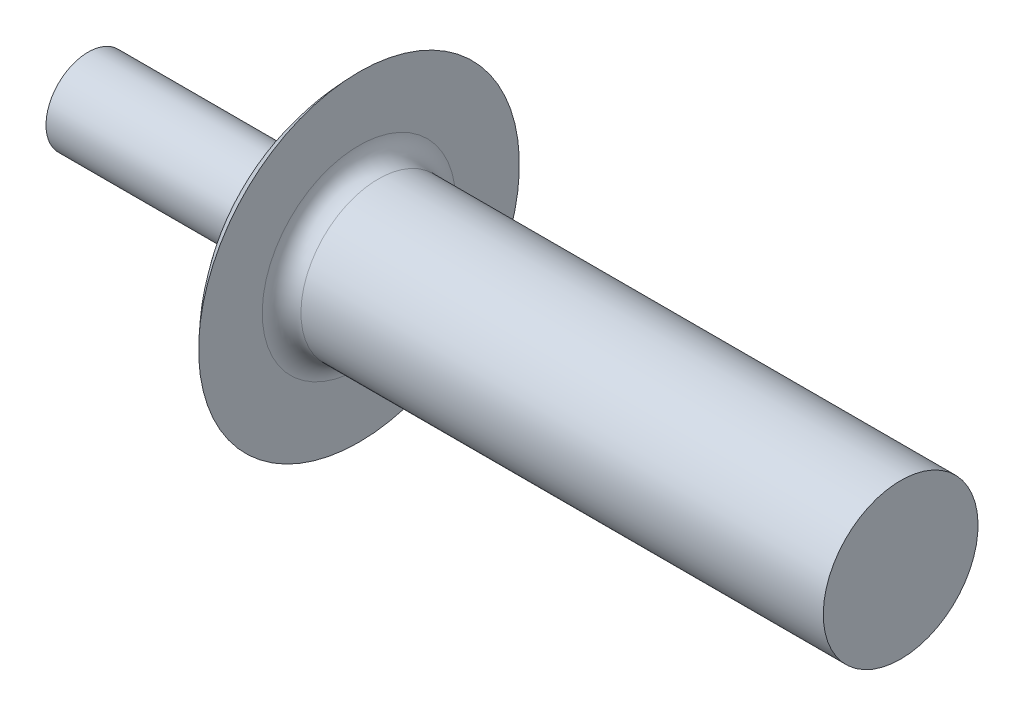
ISO-10303-21;
HEADER;
FILE_DESCRIPTION(('STEP AP214'),'2;1');
FILE_NAME('part.step','',(''),(''),'','','');
FILE_SCHEMA(('AUTOMOTIVE_DESIGN { 1 0 10303 214 1 1 1 1 }'));
ENDSEC;
DATA;
#1=APPLICATION_CONTEXT('core data for automotive mechanical design processes');
#2=APPLICATION_PROTOCOL_DEFINITION('international standard','automotive_design',2000,#1);
#3=PRODUCT_CONTEXT('',#1,'mechanical');
#4=PRODUCT('Part','Part','',(#3));
#5=PRODUCT_RELATED_PRODUCT_CATEGORY('part','',(#4));
#6=PRODUCT_DEFINITION_FORMATION('','',#4);
#7=PRODUCT_DEFINITION_CONTEXT('part definition',#1,'design');
#8=PRODUCT_DEFINITION('design','',#6,#7);
#9=PRODUCT_DEFINITION_SHAPE('','',#8);
#10=(LENGTH_UNIT() NAMED_UNIT(*) SI_UNIT(.MILLI.,.METRE.));
#11=(NAMED_UNIT(*) PLANE_ANGLE_UNIT() SI_UNIT($,.RADIAN.));
#12=(NAMED_UNIT(*) SI_UNIT($,.STERADIAN.) SOLID_ANGLE_UNIT());
#13=UNCERTAINTY_MEASURE_WITH_UNIT(LENGTH_MEASURE(1.E-05),#10,'distance_accuracy_value','');
#14=(GEOMETRIC_REPRESENTATION_CONTEXT(3) GLOBAL_UNCERTAINTY_ASSIGNED_CONTEXT((#13)) GLOBAL_UNIT_ASSIGNED_CONTEXT((#10,
#11,#12)) REPRESENTATION_CONTEXT('',''));
#15=CARTESIAN_POINT('',(0.,0.,0.));
#16=DIRECTION('',(0.,0.,1.));
#17=DIRECTION('',(1.,0.,0.));
#18=AXIS2_PLACEMENT_3D('',#15,#16,#17);
#19=CARTESIAN_POINT('',(21.,0.,0.));
#20=DIRECTION('',(-1.,0.,0.));
#21=DIRECTION('',(0.,-1.,0.));
#22=AXIS2_PLACEMENT_3D('',#19,#20,#21);
#23=PLANE('',#22);
#24=CARTESIAN_POINT('',(21.,0.,0.));
#25=DIRECTION('',(-1.,0.,0.));
#26=DIRECTION('',(0.,-1.,0.));
#27=AXIS2_PLACEMENT_3D('',#24,#25,#26);
#28=CIRCLE('',#27,2.);
#29=CARTESIAN_POINT('',(21.,-2.,0.));
#30=VERTEX_POINT('',#29);
#31=EDGE_CURVE('E40',#30,#30,#28,.T.);
#32=ORIENTED_EDGE('',*,*,#31,.F.);
#33=EDGE_LOOP('',(#32));
#34=FACE_BOUND('',#33,.T.);
#35=ADVANCED_FACE('F29',(#34),#23,.F.);
#36=CARTESIAN_POINT('',(-21.0963284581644,0.,0.));
#37=DIRECTION('',(-1.,0.,0.));
#38=DIRECTION('',(0.,-1.,0.));
#39=AXIS2_PLACEMENT_3D('',#36,#37,#38);
#40=CYLINDRICAL_SURFACE('',#39,2.);
#41=CARTESIAN_POINT('',(7.5,0.,0.));
#42=DIRECTION('',(-1.,0.,0.));
#43=DIRECTION('',(0.,-1.,0.));
#44=AXIS2_PLACEMENT_3D('',#41,#42,#43);
#45=CIRCLE('',#44,2.);
#46=CARTESIAN_POINT('',(7.5,-2.,0.));
#47=VERTEX_POINT('',#46);
#48=EDGE_CURVE('E10',#47,#47,#45,.F.);
#49=ORIENTED_EDGE('',*,*,#48,.T.);
#50=EDGE_LOOP('',(#49));
#51=FACE_BOUND('',#50,.T.);
#52=ORIENTED_EDGE('',*,*,#31,.T.);
#53=EDGE_LOOP('',(#52));
#54=FACE_BOUND('',#53,.T.);
#55=ADVANCED_FACE('F72',(#51,#54),#40,.T.);
#56=CARTESIAN_POINT('',(7.,2.,0.));
#57=DIRECTION('',(-1.,0.,0.));
#58=DIRECTION('',(0.,-1.,0.));
#59=AXIS2_PLACEMENT_3D('',#56,#57,#58);
#60=PLANE('',#59);
#61=CARTESIAN_POINT('',(7.,0.,0.));
#62=DIRECTION('',(-1.,0.,0.));
#63=DIRECTION('',(0.,-1.,0.));
#64=AXIS2_PLACEMENT_3D('',#61,#62,#63);
#65=CIRCLE('',#64,2.5);
#66=CARTESIAN_POINT('',(7.,-2.5,0.));
#67=VERTEX_POINT('',#66);
#68=EDGE_CURVE('E36',#67,#67,#65,.T.);
#69=ORIENTED_EDGE('',*,*,#68,.T.);
#70=EDGE_LOOP('',(#69));
#71=FACE_BOUND('',#70,.T.);
#72=CARTESIAN_POINT('',(7.,0.,0.));
#73=DIRECTION('',(-1.,0.,0.));
#74=DIRECTION('',(0.,-1.,0.));
#75=AXIS2_PLACEMENT_3D('',#72,#73,#74);
#76=CIRCLE('',#75,4.145);
#77=CARTESIAN_POINT('',(7.,4.145,0.));
#78=VERTEX_POINT('',#77);
#79=EDGE_CURVE('E44',#78,#78,#76,.T.);
#80=ORIENTED_EDGE('',*,*,#79,.F.);
#81=EDGE_LOOP('',(#80));
#82=FACE_BOUND('',#81,.T.);
#83=ADVANCED_FACE('F67',(#71,#82),#60,.F.);
#84=CARTESIAN_POINT('',(11.2032426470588,0.,0.));
#85=DIRECTION('',(-1.,0.,0.));
#86=DIRECTION('',(0.,1.,0.));
#87=AXIS2_PLACEMENT_3D('',#84,#85,#86);
#88=SPHERICAL_SURFACE('',#87,5.90324264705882);
#89=CARTESIAN_POINT('',(5.40150379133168,0.,0.));
#90=DIRECTION('',(-1.,0.,0.));
#91=DIRECTION('',(0.,-1.,0.));
#92=AXIS2_PLACEMENT_3D('',#89,#90,#91);
#93=CIRCLE('',#92,1.09);
#94=CARTESIAN_POINT('',(5.40150379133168,1.08999999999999,0.));
#95=VERTEX_POINT('',#94);
#96=EDGE_CURVE('E49',#95,#95,#93,.T.);
#97=CARTESIAN_POINT('',(5.40150379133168,1.08999999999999,0.));
#98=CARTESIAN_POINT('',(5.40823349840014,1.12582041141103,0.));
#99=CARTESIAN_POINT('',(5.41529502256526,1.16157848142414,0.));
#100=CARTESIAN_POINT('',(5.4300791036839,1.23295770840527,0.));
#101=CARTESIAN_POINT('',(5.43780166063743,1.26857886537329,0.));
#102=CARTESIAN_POINT('',(5.45390520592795,1.33967203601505,0.));
#103=CARTESIAN_POINT('',(5.46228619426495,1.37514404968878,0.));
#104=CARTESIAN_POINT('',(5.47970371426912,1.44592676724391,0.));
#105=CARTESIAN_POINT('',(5.48874024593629,1.48123747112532,0.));
#106=CARTESIAN_POINT('',(5.50746575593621,1.551685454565,0.));
#107=CARTESIAN_POINT('',(5.51715473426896,1.58682273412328,0.));
#108=CARTESIAN_POINT('',(5.53718181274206,1.65691181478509,0.));
#109=CARTESIAN_POINT('',(5.5475199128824,1.69186361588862,0.));
#110=CARTESIAN_POINT('',(5.56884168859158,1.76156974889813,0.));
#111=CARTESIAN_POINT('',(5.57982536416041,1.7963240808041,0.));
#112=CARTESIAN_POINT('',(5.6024345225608,1.86562335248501,0.));
#113=CARTESIAN_POINT('',(5.61406000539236,1.90016829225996,0.));
#114=CARTESIAN_POINT('',(5.63794879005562,1.96903692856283,0.));
#115=CARTESIAN_POINT('',(5.65021209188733,2.00336062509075,0.));
#116=CARTESIAN_POINT('',(5.67537230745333,2.07177499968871,0.));
#117=CARTESIAN_POINT('',(5.68826922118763,2.10586567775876,0.));
#118=CARTESIAN_POINT('',(5.71469223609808,2.17380232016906,0.));
#119=CARTESIAN_POINT('',(5.72821833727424,2.2076482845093,0.));
#120=CARTESIAN_POINT('',(5.75589508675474,2.27508388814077,0.));
#121=CARTESIAN_POINT('',(5.77004573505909,2.30867352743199,0.));
#122=CARTESIAN_POINT('',(5.79896672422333,2.37558495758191,0.));
#123=CARTESIAN_POINT('',(5.81373706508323,2.40890674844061,0.));
#124=CARTESIAN_POINT('',(5.84389237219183,2.47527105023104,0.));
#125=CARTESIAN_POINT('',(5.85927733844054,2.50831356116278,0.));
#126=CARTESIAN_POINT('',(5.89065661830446,2.57410796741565,0.));
#127=CARTESIAN_POINT('',(5.90665093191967,2.60685986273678,0.));
#128=CARTESIAN_POINT('',(5.93924341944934,2.67206180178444,0.));
#129=CARTESIAN_POINT('',(5.9558415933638,2.70451184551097,0.));
#130=CARTESIAN_POINT('',(5.98963610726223,2.76909894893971,0.));
#131=CARTESIAN_POINT('',(6.0068324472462,2.80123600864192,0.));
#132=CARTESIAN_POINT('',(6.04181739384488,2.86518611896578,0.));
#133=CARTESIAN_POINT('',(6.05960600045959,2.89699916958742,0.));
#134=CARTESIAN_POINT('',(6.09576937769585,2.96029034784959,0.));
#135=CARTESIAN_POINT('',(6.11414414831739,2.99176847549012,0.));
#136=CARTESIAN_POINT('',(6.15147354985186,3.05437900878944,0.));
#137=CARTESIAN_POINT('',(6.17042818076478,3.08551141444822,0.));
#138=CARTESIAN_POINT('',(6.20891080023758,3.14741982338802,0.));
#139=CARTESIAN_POINT('',(6.22843878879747,3.17819582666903,0.));
#140=CARTESIAN_POINT('',(6.26806142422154,3.23938087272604,0.));
#141=CARTESIAN_POINT('',(6.28815607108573,3.26978991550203,0.));
#142=CARTESIAN_POINT('',(6.32890512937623,3.33023060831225,0.));
#143=CARTESIAN_POINT('',(6.34955954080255,3.36026225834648,0.));
#144=CARTESIAN_POINT('',(6.39142104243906,3.41993786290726,0.));
#145=CARTESIAN_POINT('',(6.41262813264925,3.44958181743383,0.));
#146=CARTESIAN_POINT('',(6.45558771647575,3.50847186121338,0.));
#147=CARTESIAN_POINT('',(6.47734021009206,3.53771795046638,0.));
#148=CARTESIAN_POINT('',(6.52138313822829,3.59580223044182,0.));
#149=CARTESIAN_POINT('',(6.54367357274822,3.62464042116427,0.));
#150=CARTESIAN_POINT('',(6.58878473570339,3.68189901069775,0.));
#151=CARTESIAN_POINT('',(6.61160546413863,3.71031940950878,0.));
#152=CARTESIAN_POINT('',(6.65776938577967,3.76673266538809,0.));
#153=CARTESIAN_POINT('',(6.68111257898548,3.79472552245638,0.));
#154=CARTESIAN_POINT('',(6.72831342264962,3.85027409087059,0.));
#155=CARTESIAN_POINT('',(6.75217107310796,3.8778298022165,0.));
#156=CARTESIAN_POINT('',(6.80039264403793,3.93249462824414,0.));
#157=CARTESIAN_POINT('',(6.82475656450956,3.95960374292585,0.));
#158=CARTESIAN_POINT('',(6.87398232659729,4.0133660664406,0.));
#159=CARTESIAN_POINT('',(6.89884416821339,4.04001927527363,0.));
#160=CARTESIAN_POINT('',(6.94905720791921,4.09286067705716,0.));
#161=CARTESIAN_POINT('',(6.97440840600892,4.11904887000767,0.));
#162=CARTESIAN_POINT('',(7.,4.145,0.));
#163=B_SPLINE_CURVE_WITH_KNOTS('',3,(#97,#98,#99,#100,#101,#102,#103,#104,#105,#106,#107,#108,
#109,#110,#111,#112,#113,#114,#115,#116,#117,#118,#119,#120,#121,#122,#123,#124,#125,#126,#127,
#128,#129,#130,#131,#132,#133,#134,#135,#136,#137,#138,#139,#140,#141,#142,#143,#144,#145,#146,
#147,#148,#149,#150,#151,#152,#153,#154,#155,#156,#157,#158,#159,#160,#161,#162),.UNSPECIFIED.,
.F.,.F.,(4,2,2,2,2,2,2,2,2,2,2,2,2,2,2,2,2,2,2,2,2,2,2,2,2,2,2,2,2,2,2,2,4),(0.,
0.109339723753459,0.218679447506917,0.328019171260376,0.437358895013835,0.546698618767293,
0.656038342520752,0.765378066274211,0.87471779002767,0.984057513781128,1.09339723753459,
1.20273696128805,1.31207668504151,1.42141640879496,1.53075613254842,1.64009585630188,
1.74943558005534,1.8587753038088,1.96811502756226,2.07745475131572,2.18679447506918,
2.29613419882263,2.40547392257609,2.51481364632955,2.62415337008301,2.73349309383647,
2.84283281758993,2.95217254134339,3.06151226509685,3.17085198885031,3.28019171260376,
3.38953143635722,3.49887116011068),.UNSPECIFIED.);
#164=EDGE_CURVE('BSEAM61',#95,#78,#163,.T.);
#165=ORIENTED_EDGE('',*,*,#96,.F.);
#166=ORIENTED_EDGE('',*,*,#79,.T.);
#167=ORIENTED_EDGE('',*,*,#164,.T.);
#168=ORIENTED_EDGE('',*,*,#164,.F.);
#169=EDGE_LOOP('',(#165,#167,#166,#168));
#170=FACE_BOUND('',#169,.T.);
#171=ADVANCED_FACE('F61',(#170),#88,.T.);
#172=CARTESIAN_POINT('',(-21.0963284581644,0.,0.));
#173=DIRECTION('',(-1.,0.,0.));
#174=DIRECTION('',(0.,-1.,0.));
#175=AXIS2_PLACEMENT_3D('',#172,#173,#174);
#176=CYLINDRICAL_SURFACE('',#175,1.09);
#177=CARTESIAN_POINT('',(0.,0.,0.));
#178=DIRECTION('',(-1.,0.,0.));
#179=DIRECTION('',(0.,-1.,0.));
#180=AXIS2_PLACEMENT_3D('',#177,#178,#179);
#181=CIRCLE('',#180,1.09);
#182=CARTESIAN_POINT('',(0.,-1.09,0.));
#183=VERTEX_POINT('',#182);
#184=EDGE_CURVE('E52',#183,#183,#181,.T.);
#185=ORIENTED_EDGE('',*,*,#184,.F.);
#186=EDGE_LOOP('',(#185));
#187=FACE_BOUND('',#186,.T.);
#188=ORIENTED_EDGE('',*,*,#96,.T.);
#189=EDGE_LOOP('',(#188));
#190=FACE_BOUND('',#189,.T.);
#191=ADVANCED_FACE('F58',(#187,#190),#176,.T.);
#192=CARTESIAN_POINT('',(0.,1.09,0.));
#193=DIRECTION('',(1.,0.,0.));
#194=DIRECTION('',(0.,1.,0.));
#195=AXIS2_PLACEMENT_3D('',#192,#193,#194);
#196=PLANE('',#195);
#197=ORIENTED_EDGE('',*,*,#184,.T.);
#198=EDGE_LOOP('',(#197));
#199=FACE_BOUND('',#198,.T.);
#200=ADVANCED_FACE('F56',(#199),#196,.F.);
#201=CARTESIAN_POINT('',(7.5,0.,0.));
#202=DIRECTION('',(-1.,0.,0.));
#203=DIRECTION('',(0.,-1.,0.));
#204=AXIS2_PLACEMENT_3D('',#201,#202,#203);
#205=TOROIDAL_SURFACE('',#204,2.5,0.5);
#206=ORIENTED_EDGE('',*,*,#48,.F.);
#207=EDGE_LOOP('',(#206));
#208=FACE_BOUND('',#207,.T.);
#209=ORIENTED_EDGE('',*,*,#68,.F.);
#210=EDGE_LOOP('',(#209));
#211=FACE_BOUND('',#210,.T.);
#212=ADVANCED_FACE('F31',(#208,#211),#205,.F.);
#213=CLOSED_SHELL('',(#35,#55,#83,#171,#191,#200,#212));
#214=MANIFOLD_SOLID_BREP('B2',#213);
#215=ADVANCED_BREP_SHAPE_REPRESENTATION('',(#18,#214),#14);
#216=SHAPE_DEFINITION_REPRESENTATION(#9,#215);
ENDSEC;
END-ISO-10303-21;
